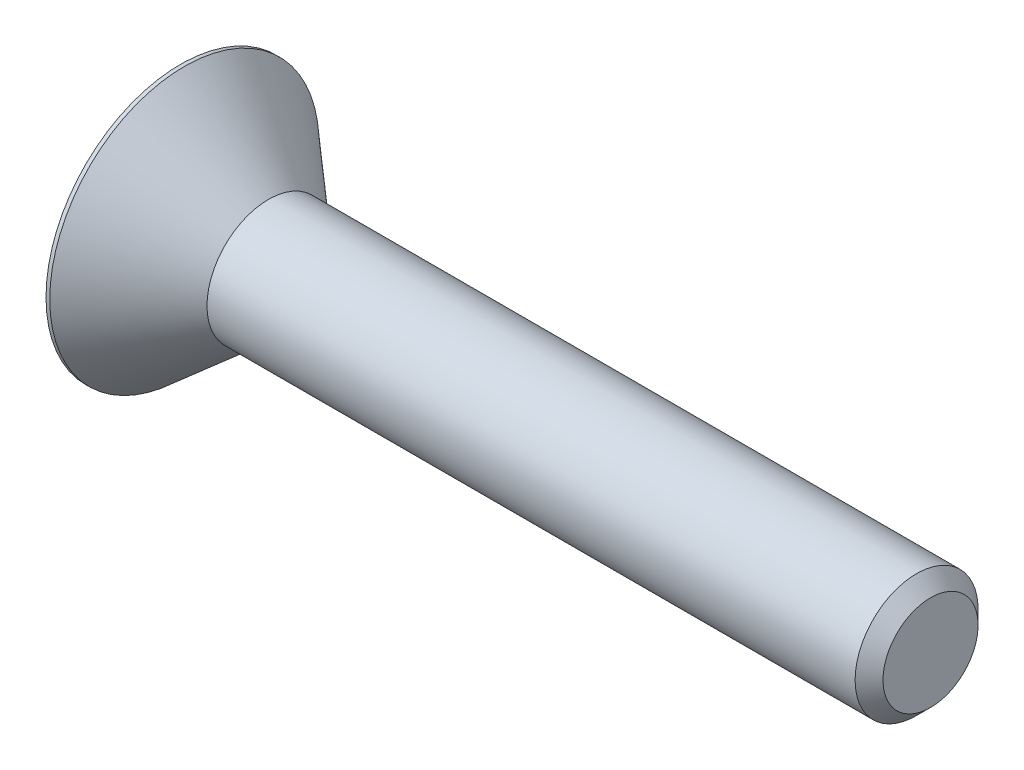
from build123d import *

# Parameters (mm, degrees)
HEX_2_DEPTH = 1.9304


with BuildPart() as part:
    # BodySke → BaseBody (revolve)
    with BuildSketch(Plane.XY, mode=Mode.PRIVATE) as basebody_sk:
        Polygon((0, 0), (0, 4.5593), (0.127, 4.5593), (2.97588736, 2.0828), (24.92756, 2.0828), (25.4, 1.61036), (25.4, 0), align=None)
    revolve(basebody_sk.sketch.rotate(Axis((0, 0, 0), (1, 0, 0)), 90), axis=Axis((0, 0, 0), (1, 0, 0)))

    # Sketch2 → PreBroach (revolve, cut)
    with BuildSketch(Plane.XY, mode=Mode.PRIVATE) as prebroach_sk:
        Polygon((0, 1.1938), (1.9304, 1.1938), (2.619640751, 0), (0, 0), align=None)
    revolve(prebroach_sk.sketch.rotate(Axis((0, 0, 0), (1, 0, 0)), 90), axis=Axis((0, 0, 0), (1, 0, 0)), mode=Mode.SUBTRACT)

    # Sketch3 → Hex 2 (cut)
    with BuildSketch(Plane.ZY):
        Polygon((-1.1938, -0.689240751), (-1.1938, 0.689240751), (0, 1.378481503), (1.1938, 0.689240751), (1.1938, -0.689240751), (0, -1.378481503), align=None)
    extrude(amount=-HEX_2_DEPTH, mode=Mode.SUBTRACT)


solid = part.part
